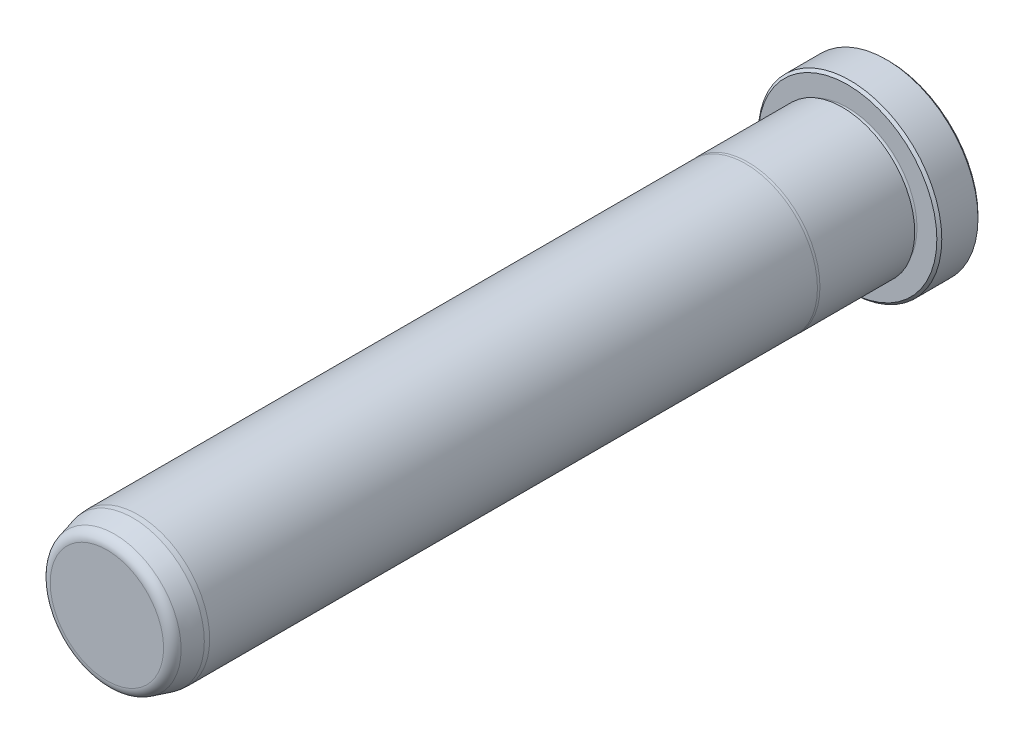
ISO-10303-21;
HEADER;
FILE_DESCRIPTION(('STEP AP214'),'2;1');
FILE_NAME('part.step','',(''),(''),'','','');
FILE_SCHEMA(('AUTOMOTIVE_DESIGN { 1 0 10303 214 1 1 1 1 }'));
ENDSEC;
DATA;
#1=APPLICATION_CONTEXT('core data for automotive mechanical design processes');
#2=APPLICATION_PROTOCOL_DEFINITION('international standard','automotive_design',2000,#1);
#3=PRODUCT_CONTEXT('',#1,'mechanical');
#4=PRODUCT('Part','Part','',(#3));
#5=PRODUCT_RELATED_PRODUCT_CATEGORY('part','',(#4));
#6=PRODUCT_DEFINITION_FORMATION('','',#4);
#7=PRODUCT_DEFINITION_CONTEXT('part definition',#1,'design');
#8=PRODUCT_DEFINITION('design','',#6,#7);
#9=PRODUCT_DEFINITION_SHAPE('','',#8);
#10=(LENGTH_UNIT() NAMED_UNIT(*) SI_UNIT(.MILLI.,.METRE.));
#11=(NAMED_UNIT(*) PLANE_ANGLE_UNIT() SI_UNIT($,.RADIAN.));
#12=(NAMED_UNIT(*) SI_UNIT($,.STERADIAN.) SOLID_ANGLE_UNIT());
#13=UNCERTAINTY_MEASURE_WITH_UNIT(LENGTH_MEASURE(1.E-05),#10,'distance_accuracy_value','');
#14=(GEOMETRIC_REPRESENTATION_CONTEXT(3) GLOBAL_UNCERTAINTY_ASSIGNED_CONTEXT((#13)) GLOBAL_UNIT_ASSIGNED_CONTEXT((#10,
#11,#12)) REPRESENTATION_CONTEXT('',''));
#15=CARTESIAN_POINT('',(0.,0.,0.));
#16=DIRECTION('',(0.,0.,1.));
#17=DIRECTION('',(1.,0.,0.));
#18=AXIS2_PLACEMENT_3D('',#15,#16,#17);
#19=CARTESIAN_POINT('',(0.,0.,0.));
#20=DIRECTION('',(0.,0.,1.));
#21=DIRECTION('',(1.,0.,0.));
#22=AXIS2_PLACEMENT_3D('',#19,#20,#21);
#23=PLANE('',#22);
#24=CARTESIAN_POINT('',(0.,0.,0.));
#25=DIRECTION('',(0.,0.,1.));
#26=DIRECTION('',(1.,0.,0.));
#27=AXIS2_PLACEMENT_3D('',#24,#25,#26);
#28=CIRCLE('',#27,13.7795);
#29=CARTESIAN_POINT('',(13.7795,0.,0.));
#30=VERTEX_POINT('',#29);
#31=EDGE_CURVE('E37',#30,#30,#28,.F.);
#32=ORIENTED_EDGE('',*,*,#31,.T.);
#33=EDGE_LOOP('',(#32));
#34=FACE_BOUND('',#33,.T.);
#35=ADVANCED_FACE('F30',(#34),#23,.F.);
#36=CARTESIAN_POINT('',(0.,0.,0.));
#37=DIRECTION('',(0.,0.,1.));
#38=DIRECTION('',(1.,0.,0.));
#39=AXIS2_PLACEMENT_3D('',#36,#37,#38);
#40=CYLINDRICAL_SURFACE('',#39,14.1605);
#41=CARTESIAN_POINT('',(0.,0.,0.380999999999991));
#42=DIRECTION('',(0.,0.,1.));
#43=DIRECTION('',(1.,0.,0.));
#44=AXIS2_PLACEMENT_3D('',#41,#42,#43);
#45=CIRCLE('',#44,14.1605);
#46=CARTESIAN_POINT('',(14.1605,0.,0.380999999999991));
#47=VERTEX_POINT('',#46);
#48=EDGE_CURVE('E41',#47,#47,#45,.T.);
#49=ORIENTED_EDGE('',*,*,#48,.T.);
#50=EDGE_LOOP('',(#49));
#51=FACE_BOUND('',#50,.T.);
#52=CARTESIAN_POINT('',(0.,0.,5.96900000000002));
#53=DIRECTION('',(0.,0.,-1.));
#54=DIRECTION('',(-1.,0.,0.));
#55=AXIS2_PLACEMENT_3D('',#52,#53,#54);
#56=CIRCLE('',#55,14.1605);
#57=CARTESIAN_POINT('',(-14.1605,0.,5.96900000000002));
#58=VERTEX_POINT('',#57);
#59=EDGE_CURVE('E45',#58,#58,#56,.T.);
#60=ORIENTED_EDGE('',*,*,#59,.T.);
#61=EDGE_LOOP('',(#60));
#62=FACE_BOUND('',#61,.T.);
#63=ADVANCED_FACE('F118',(#51,#62),#40,.T.);
#64=CARTESIAN_POINT('',(0.,14.1605,6.35));
#65=DIRECTION('',(0.,0.,-1.));
#66=DIRECTION('',(-1.,0.,0.));
#67=AXIS2_PLACEMENT_3D('',#64,#65,#66);
#68=PLANE('',#67);
#69=CARTESIAN_POINT('',(0.,0.,6.35));
#70=DIRECTION('',(0.,0.,-1.));
#71=DIRECTION('',(-1.,0.,0.));
#72=AXIS2_PLACEMENT_3D('',#69,#70,#71);
#73=CIRCLE('',#72,13.7795);
#74=CARTESIAN_POINT('',(-13.7795,0.,6.35));
#75=VERTEX_POINT('',#74);
#76=EDGE_CURVE('E10',#75,#75,#73,.F.);
#77=ORIENTED_EDGE('',*,*,#76,.T.);
#78=EDGE_LOOP('',(#77));
#79=FACE_BOUND('',#78,.T.);
#80=CARTESIAN_POINT('',(0.,0.,6.35));
#81=DIRECTION('',(0.,0.,1.));
#82=DIRECTION('',(1.,0.,0.));
#83=AXIS2_PLACEMENT_3D('',#80,#81,#82);
#84=CIRCLE('',#83,10.7188);
#85=CARTESIAN_POINT('',(10.7188,0.,6.35));
#86=VERTEX_POINT('',#85);
#87=EDGE_CURVE('E56',#86,#86,#84,.T.);
#88=ORIENTED_EDGE('',*,*,#87,.F.);
#89=EDGE_LOOP('',(#88));
#90=FACE_BOUND('',#89,.T.);
#91=ADVANCED_FACE('F113',(#79,#90),#68,.F.);
#92=CARTESIAN_POINT('',(0.,0.,6.731));
#93=DIRECTION('',(0.,0.,1.));
#94=DIRECTION('',(1.,0.,0.));
#95=AXIS2_PLACEMENT_3D('',#92,#93,#94);
#96=TOROIDAL_SURFACE('',#95,10.7188,0.381000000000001);
#97=CARTESIAN_POINT('',(0.,0.,7.112));
#98=DIRECTION('',(0.,0.,1.));
#99=DIRECTION('',(1.,0.,0.));
#100=AXIS2_PLACEMENT_3D('',#97,#98,#99);
#101=CIRCLE('',#100,10.7188);
#102=CARTESIAN_POINT('',(10.7188,0.,7.112));
#103=VERTEX_POINT('',#102);
#104=EDGE_CURVE('E59',#103,#103,#101,.T.);
#105=ORIENTED_EDGE('',*,*,#104,.F.);
#106=EDGE_LOOP('',(#105));
#107=FACE_BOUND('',#106,.T.);
#108=ORIENTED_EDGE('',*,*,#87,.T.);
#109=EDGE_LOOP('',(#108));
#110=FACE_BOUND('',#109,.T.);
#111=ADVANCED_FACE('F107',(#107,#110),#96,.F.);
#112=CARTESIAN_POINT('',(0.,10.7188,7.112));
#113=DIRECTION('',(0.,0.,1.));
#114=DIRECTION('',(1.,0.,0.));
#115=AXIS2_PLACEMENT_3D('',#112,#113,#114);
#116=PLANE('',#115);
#117=CARTESIAN_POINT('',(0.,0.,7.112));
#118=DIRECTION('',(0.,0.,1.));
#119=DIRECTION('',(1.,0.,0.));
#120=AXIS2_PLACEMENT_3D('',#117,#118,#119);
#121=CIRCLE('',#120,11.1252);
#122=CARTESIAN_POINT('',(11.1252,0.,7.112));
#123=VERTEX_POINT('',#122);
#124=EDGE_CURVE('E62',#123,#123,#121,.T.);
#125=ORIENTED_EDGE('',*,*,#124,.F.);
#126=EDGE_LOOP('',(#125));
#127=FACE_BOUND('',#126,.T.);
#128=ORIENTED_EDGE('',*,*,#104,.T.);
#129=EDGE_LOOP('',(#128));
#130=FACE_BOUND('',#129,.T.);
#131=ADVANCED_FACE('F101',(#127,#130),#116,.F.);
#132=CARTESIAN_POINT('',(0.,0.,0.));
#133=DIRECTION('',(0.,0.,1.));
#134=DIRECTION('',(1.,0.,0.));
#135=AXIS2_PLACEMENT_3D('',#132,#133,#134);
#136=CYLINDRICAL_SURFACE('',#135,11.1252);
#137=CARTESIAN_POINT('',(0.,0.,21.7347630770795));
#138=DIRECTION('',(0.,0.,1.));
#139=DIRECTION('',(1.,0.,0.));
#140=AXIS2_PLACEMENT_3D('',#137,#138,#139);
#141=CIRCLE('',#140,11.1252);
#142=CARTESIAN_POINT('',(11.1252,0.,21.7347630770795));
#143=VERTEX_POINT('',#142);
#144=EDGE_CURVE('E65',#143,#143,#141,.T.);
#145=ORIENTED_EDGE('',*,*,#144,.F.);
#146=EDGE_LOOP('',(#145));
#147=FACE_BOUND('',#146,.T.);
#148=ORIENTED_EDGE('',*,*,#124,.T.);
#149=EDGE_LOOP('',(#148));
#150=FACE_BOUND('',#149,.T.);
#151=ADVANCED_FACE('F95',(#147,#150),#136,.T.);
#152=CARTESIAN_POINT('',(0.,0.,21.7347630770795));
#153=DIRECTION('',(0.,0.,-1.));
#154=DIRECTION('',(-1.,0.,0.));
#155=AXIS2_PLACEMENT_3D('',#152,#153,#154);
#156=CONICAL_SURFACE('',#155,11.1252,0.0698131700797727);
#157=CARTESIAN_POINT('',(0.,0.,22.098));
#158=DIRECTION('',(0.,0.,1.));
#159=DIRECTION('',(1.,0.,0.));
#160=AXIS2_PLACEMENT_3D('',#157,#158,#159);
#161=CIRCLE('',#160,11.0998);
#162=CARTESIAN_POINT('',(11.0998,0.,22.098));
#163=VERTEX_POINT('',#162);
#164=EDGE_CURVE('E68',#163,#163,#161,.T.);
#165=ORIENTED_EDGE('',*,*,#164,.F.);
#166=EDGE_LOOP('',(#165));
#167=FACE_BOUND('',#166,.T.);
#168=ORIENTED_EDGE('',*,*,#144,.T.);
#169=EDGE_LOOP('',(#168));
#170=FACE_BOUND('',#169,.T.);
#171=ADVANCED_FACE('F89',(#167,#170),#156,.T.);
#172=CARTESIAN_POINT('',(0.,0.,0.));
#173=DIRECTION('',(0.,0.,1.));
#174=DIRECTION('',(1.,0.,0.));
#175=AXIS2_PLACEMENT_3D('',#172,#173,#174);
#176=CYLINDRICAL_SURFACE('',#175,11.0998);
#177=CARTESIAN_POINT('',(0.,0.,115.8875));
#178=DIRECTION('',(0.,0.,1.));
#179=DIRECTION('',(1.,0.,0.));
#180=AXIS2_PLACEMENT_3D('',#177,#178,#179);
#181=CIRCLE('',#180,11.0998);
#182=CARTESIAN_POINT('',(11.0998,0.,115.8875));
#183=VERTEX_POINT('',#182);
#184=EDGE_CURVE('E71',#183,#183,#181,.T.);
#185=ORIENTED_EDGE('',*,*,#184,.F.);
#186=EDGE_LOOP('',(#185));
#187=FACE_BOUND('',#186,.T.);
#188=ORIENTED_EDGE('',*,*,#164,.T.);
#189=EDGE_LOOP('',(#188));
#190=FACE_BOUND('',#189,.T.);
#191=ADVANCED_FACE('F83',(#187,#190),#176,.T.);
#192=CARTESIAN_POINT('',(0.,0.,115.8875));
#193=DIRECTION('',(0.,0.,-1.));
#194=DIRECTION('',(-1.,0.,0.));
#195=AXIS2_PLACEMENT_3D('',#192,#193,#194);
#196=CONICAL_SURFACE('',#195,11.0998,0.0872664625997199);
#197=CARTESIAN_POINT('',(0.,0.,116.6495));
#198=DIRECTION('',(0.,0.,1.));
#199=DIRECTION('',(1.,0.,0.));
#200=AXIS2_PLACEMENT_3D('',#197,#198,#199);
#201=CIRCLE('',#200,11.0331336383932);
#202=CARTESIAN_POINT('',(11.0331336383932,0.,116.6495));
#203=VERTEX_POINT('',#202);
#204=EDGE_CURVE('E74',#203,#203,#201,.T.);
#205=ORIENTED_EDGE('',*,*,#204,.F.);
#206=EDGE_LOOP('',(#205));
#207=FACE_BOUND('',#206,.T.);
#208=ORIENTED_EDGE('',*,*,#184,.T.);
#209=EDGE_LOOP('',(#208));
#210=FACE_BOUND('',#209,.T.);
#211=ADVANCED_FACE('F80',(#207,#210),#196,.T.);
#212=CARTESIAN_POINT('',(0.,0.,116.6495));
#213=DIRECTION('',(0.,0.,-1.));
#214=DIRECTION('',(-1.,0.,0.));
#215=AXIS2_PLACEMENT_3D('',#212,#213,#214);
#216=CONICAL_SURFACE('',#215,11.0331336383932,0.26179938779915);
#217=CARTESIAN_POINT('',(0.,0.,119.4733752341));
#218=DIRECTION('',(0.,0.,1.));
#219=DIRECTION('',(1.,0.,0.));
#220=AXIS2_PLACEMENT_3D('',#217,#218,#219);
#221=CIRCLE('',#220,10.2764785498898);
#222=CARTESIAN_POINT('',(10.2764785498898,0.,119.4733752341));
#223=VERTEX_POINT('',#222);
#224=EDGE_CURVE('E50',#223,#223,#221,.F.);
#225=ORIENTED_EDGE('',*,*,#224,.T.);
#226=EDGE_LOOP('',(#225));
#227=FACE_BOUND('',#226,.T.);
#228=ORIENTED_EDGE('',*,*,#204,.T.);
#229=EDGE_LOOP('',(#228));
#230=FACE_BOUND('',#229,.T.);
#231=ADVANCED_FACE('F78',(#227,#230),#216,.T.);
#232=CARTESIAN_POINT('',(0.,9.96120289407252,120.65));
#233=DIRECTION('',(0.,0.,-1.));
#234=DIRECTION('',(-1.,0.,0.));
#235=AXIS2_PLACEMENT_3D('',#232,#233,#234);
#236=PLANE('',#235);
#237=CARTESIAN_POINT('',(0.,0.,120.65));
#238=DIRECTION('',(0.,0.,-1.));
#239=DIRECTION('',(-1.,0.,0.));
#240=AXIS2_PLACEMENT_3D('',#237,#238,#239);
#241=CIRCLE('',#240,8.74307130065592);
#242=CARTESIAN_POINT('',(-8.74307130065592,0.,120.65));
#243=VERTEX_POINT('',#242);
#244=EDGE_CURVE('E53',#243,#243,#241,.F.);
#245=ORIENTED_EDGE('',*,*,#244,.T.);
#246=EDGE_LOOP('',(#245));
#247=FACE_BOUND('',#246,.T.);
#248=ADVANCED_FACE('F133',(#247),#236,.F.);
#249=CARTESIAN_POINT('',(0.,0.,119.0625));
#250=DIRECTION('',(0.,0.,-1.));
#251=DIRECTION('',(-1.,0.,0.));
#252=AXIS2_PLACEMENT_3D('',#249,#250,#251);
#253=TOROIDAL_SURFACE('',#252,8.74307130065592,1.5875);
#254=ORIENTED_EDGE('',*,*,#224,.F.);
#255=EDGE_LOOP('',(#254));
#256=FACE_BOUND('',#255,.T.);
#257=ORIENTED_EDGE('',*,*,#244,.F.);
#258=EDGE_LOOP('',(#257));
#259=FACE_BOUND('',#258,.T.);
#260=ADVANCED_FACE('F130',(#256,#259),#253,.T.);
#261=CARTESIAN_POINT('',(0.,0.,0.380999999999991));
#262=DIRECTION('',(0.,0.,1.));
#263=DIRECTION('',(1.,0.,0.));
#264=AXIS2_PLACEMENT_3D('',#261,#262,#263);
#265=CONICAL_SURFACE('',#264,14.1605,0.785398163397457);
#266=ORIENTED_EDGE('',*,*,#31,.F.);
#267=EDGE_LOOP('',(#266));
#268=FACE_BOUND('',#267,.T.);
#269=ORIENTED_EDGE('',*,*,#48,.F.);
#270=EDGE_LOOP('',(#269));
#271=FACE_BOUND('',#270,.T.);
#272=ADVANCED_FACE('F132',(#268,#271),#265,.T.);
#273=CARTESIAN_POINT('',(0.,0.,6.35));
#274=DIRECTION('',(0.,0.,-1.));
#275=DIRECTION('',(-1.,0.,0.));
#276=AXIS2_PLACEMENT_3D('',#273,#274,#275);
#277=CONICAL_SURFACE('',#276,13.7795,0.785398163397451);
#278=ORIENTED_EDGE('',*,*,#59,.F.);
#279=EDGE_LOOP('',(#278));
#280=FACE_BOUND('',#279,.T.);
#281=ORIENTED_EDGE('',*,*,#76,.F.);
#282=EDGE_LOOP('',(#281));
#283=FACE_BOUND('',#282,.T.);
#284=ADVANCED_FACE('F32',(#280,#283),#277,.T.);
#285=CLOSED_SHELL('',(#35,#63,#91,#111,#131,#151,#171,#191,#211,#231,#248,#260,#272,#284));
#286=MANIFOLD_SOLID_BREP('B2',#285);
#287=ADVANCED_BREP_SHAPE_REPRESENTATION('',(#18,#286),#14);
#288=SHAPE_DEFINITION_REPRESENTATION(#9,#287);
ENDSEC;
END-ISO-10303-21;
